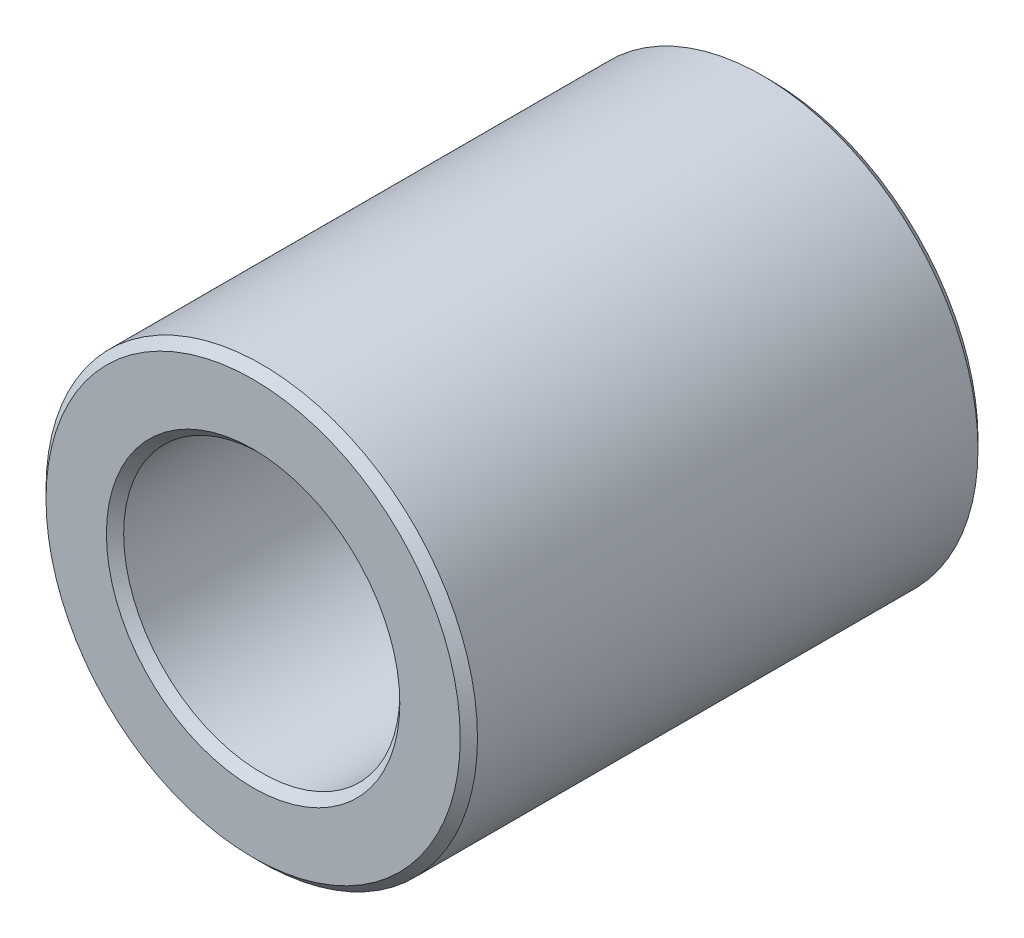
from build123d import *

# Parameters (mm, degrees)
SKETCH1_R           = 5
SKETCH1_R_2         = 3.2
BOSS_EXTRUDE2_DEPTH = 6
CHAMFER3_SIZE       = 0.2


with BuildPart() as part:
    # Sketch1 → Boss-Extrude2 (new, symmetric)
    with BuildSketch(Plane.XY):
        Circle(SKETCH1_R)
        Circle(SKETCH1_R_2, mode=Mode.SUBTRACT)
    extrude(amount=BOSS_EXTRUDE2_DEPTH, both=True)

    # Chamfer3
    chamfer3_edges = [part.edges().sort_by_distance(p)[0] for p in [
        (-5, 0, -6),
        (-5, 0, 6),
        (-3.2, 0, -6),
        (-3.2, 0, 6),
    ]]
    chamfer(chamfer3_edges, length=CHAMFER3_SIZE)


solid = part.part
